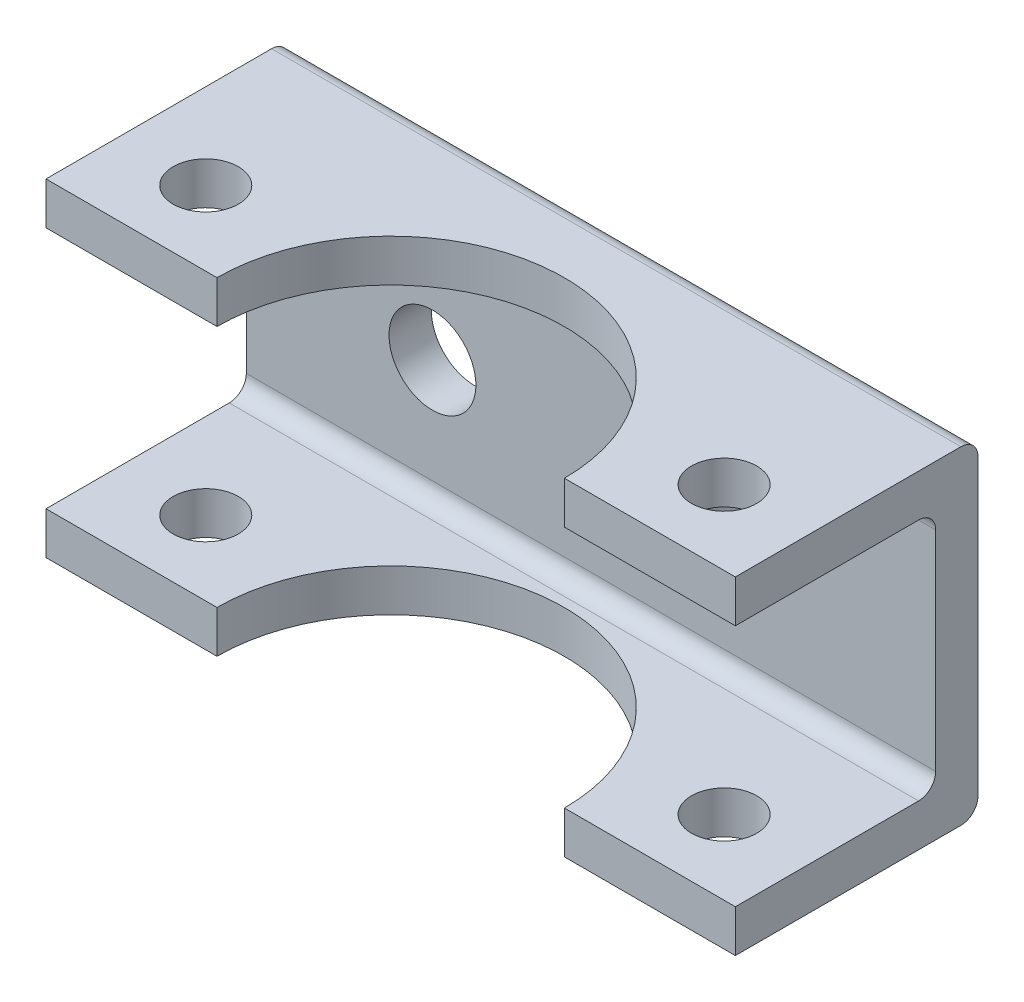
ISO-10303-21;
HEADER;
FILE_DESCRIPTION(('STEP AP214'),'2;1');
FILE_NAME('part.step','',(''),(''),'','','');
FILE_SCHEMA(('AUTOMOTIVE_DESIGN { 1 0 10303 214 1 1 1 1 }'));
ENDSEC;
DATA;
#1=APPLICATION_CONTEXT('core data for automotive mechanical design processes');
#2=APPLICATION_PROTOCOL_DEFINITION('international standard','automotive_design',2000,#1);
#3=PRODUCT_CONTEXT('',#1,'mechanical');
#4=PRODUCT('Part','Part','',(#3));
#5=PRODUCT_RELATED_PRODUCT_CATEGORY('part','',(#4));
#6=PRODUCT_DEFINITION_FORMATION('','',#4);
#7=PRODUCT_DEFINITION_CONTEXT('part definition',#1,'design');
#8=PRODUCT_DEFINITION('design','',#6,#7);
#9=PRODUCT_DEFINITION_SHAPE('','',#8);
#10=(LENGTH_UNIT() NAMED_UNIT(*) SI_UNIT(.MILLI.,.METRE.));
#11=(NAMED_UNIT(*) PLANE_ANGLE_UNIT() SI_UNIT($,.RADIAN.));
#12=(NAMED_UNIT(*) SI_UNIT($,.STERADIAN.) SOLID_ANGLE_UNIT());
#13=UNCERTAINTY_MEASURE_WITH_UNIT(LENGTH_MEASURE(1.E-05),#10,'distance_accuracy_value','');
#14=(GEOMETRIC_REPRESENTATION_CONTEXT(3) GLOBAL_UNCERTAINTY_ASSIGNED_CONTEXT((#13)) GLOBAL_UNIT_ASSIGNED_CONTEXT((#10,
#11,#12)) REPRESENTATION_CONTEXT('',''));
#15=CARTESIAN_POINT('',(0.,0.,0.));
#16=DIRECTION('',(0.,0.,1.));
#17=DIRECTION('',(1.,0.,0.));
#18=AXIS2_PLACEMENT_3D('',#15,#16,#17);
#19=CARTESIAN_POINT('',(0.,3.9,22.352));
#20=DIRECTION('',(0.,0.,-1.));
#21=DIRECTION('',(-1.,0.,0.));
#22=AXIS2_PLACEMENT_3D('',#19,#20,#21);
#23=PLANE('',#22);
#24=DIRECTION('',(1.,0.,0.));
#25=VECTOR('',#24,1.);
#26=CARTESIAN_POINT('',(0.,0.,22.352));
#27=LINE('',#26,#25);
#28=CARTESIAN_POINT('',(0.,0.,22.352));
#29=VERTEX_POINT('',#28);
#30=CARTESIAN_POINT('',(15.75,0.,22.352));
#31=VERTEX_POINT('',#30);
#32=EDGE_CURVE('E180',#29,#31,#27,.T.);
#33=ORIENTED_EDGE('',*,*,#32,.T.);
#34=DIRECTION('',(0.,1.,0.));
#35=VECTOR('',#34,1.);
#36=CARTESIAN_POINT('',(15.75,0.,22.352));
#37=LINE('',#36,#35);
#38=CARTESIAN_POINT('',(15.75,3.9,22.352));
#39=VERTEX_POINT('',#38);
#40=EDGE_CURVE('E160',#31,#39,#37,.T.);
#41=ORIENTED_EDGE('',*,*,#40,.T.);
#42=DIRECTION('',(1.,0.,0.));
#43=VECTOR('',#42,1.);
#44=CARTESIAN_POINT('',(0.,3.9,22.352));
#45=LINE('',#44,#43);
#46=CARTESIAN_POINT('',(0.,3.9,22.352));
#47=VERTEX_POINT('',#46);
#48=EDGE_CURVE('E338',#47,#39,#45,.T.);
#49=ORIENTED_EDGE('',*,*,#48,.F.);
#50=DIRECTION('',(0.,-1.,0.));
#51=VECTOR('',#50,1.);
#52=CARTESIAN_POINT('',(0.,3.9,22.352));
#53=LINE('',#52,#51);
#54=EDGE_CURVE('E188',#47,#29,#53,.T.);
#55=ORIENTED_EDGE('',*,*,#54,.T.);
#56=EDGE_LOOP('',(#33,#41,#49,#55));
#57=FACE_BOUND('',#56,.T.);
#58=ADVANCED_FACE('F45',(#57),#23,.F.);
#59=CARTESIAN_POINT('',(0.,30.21,22.352));
#60=DIRECTION('',(0.,0.,-1.));
#61=DIRECTION('',(-1.,0.,0.));
#62=AXIS2_PLACEMENT_3D('',#59,#60,#61);
#63=PLANE('',#62);
#64=DIRECTION('',(1.,0.,0.));
#65=VECTOR('',#64,1.);
#66=CARTESIAN_POINT('',(0.,26.31,22.352));
#67=LINE('',#66,#65);
#68=CARTESIAN_POINT('',(0.,26.31,22.352));
#69=VERTEX_POINT('',#68);
#70=CARTESIAN_POINT('',(15.75,26.31,22.352));
#71=VERTEX_POINT('',#70);
#72=EDGE_CURVE('E327',#69,#71,#67,.T.);
#73=ORIENTED_EDGE('',*,*,#72,.T.);
#74=CARTESIAN_POINT('',(15.75,30.21,22.352));
#75=VERTEX_POINT('',#74);
#76=EDGE_CURVE('E173',#71,#75,#37,.T.);
#77=ORIENTED_EDGE('',*,*,#76,.T.);
#78=DIRECTION('',(1.,0.,0.));
#79=VECTOR('',#78,1.);
#80=CARTESIAN_POINT('',(0.,30.21,22.352));
#81=LINE('',#80,#79);
#82=CARTESIAN_POINT('',(0.,30.21,22.352));
#83=VERTEX_POINT('',#82);
#84=EDGE_CURVE('E289',#83,#75,#81,.T.);
#85=ORIENTED_EDGE('',*,*,#84,.F.);
#86=DIRECTION('',(0.,-1.,0.));
#87=VECTOR('',#86,1.);
#88=CARTESIAN_POINT('',(0.,30.21,22.352));
#89=LINE('',#88,#87);
#90=EDGE_CURVE('E196',#83,#69,#89,.T.);
#91=ORIENTED_EDGE('',*,*,#90,.T.);
#92=EDGE_LOOP('',(#73,#77,#85,#91));
#93=FACE_BOUND('',#92,.T.);
#94=ADVANCED_FACE('F368',(#93),#63,.F.);
#95=CARTESIAN_POINT('',(0.,0.,3.9));
#96=DIRECTION('',(-1.,0.,0.));
#97=DIRECTION('',(0.,0.,1.));
#98=AXIS2_PLACEMENT_3D('',#95,#96,#97);
#99=PLANE('',#98);
#100=DIRECTION('',(0.,0.,1.));
#101=VECTOR('',#100,1.);
#102=CARTESIAN_POINT('',(0.,30.21,0.));
#103=LINE('',#102,#101);
#104=CARTESIAN_POINT('',(0.,30.21,1.5748));
#105=VERTEX_POINT('',#104);
#106=EDGE_CURVE('E297',#105,#83,#103,.T.);
#107=ORIENTED_EDGE('',*,*,#106,.F.);
#108=CARTESIAN_POINT('',(0.,28.6352,1.5748));
#109=DIRECTION('',(-1.,0.,0.));
#110=DIRECTION('',(0.,0.,1.));
#111=AXIS2_PLACEMENT_3D('',#108,#109,#110);
#112=CIRCLE('',#111,1.5748);
#113=CARTESIAN_POINT('',(0.,28.6352,0.));
#114=VERTEX_POINT('',#113);
#115=EDGE_CURVE('E261',#105,#114,#112,.T.);
#116=ORIENTED_EDGE('',*,*,#115,.T.);
#117=DIRECTION('',(0.,1.,0.));
#118=VECTOR('',#117,1.);
#119=CARTESIAN_POINT('',(0.,0.,0.));
#120=LINE('',#119,#118);
#121=CARTESIAN_POINT('',(0.,1.5748,0.));
#122=VERTEX_POINT('',#121);
#123=EDGE_CURVE('E207',#122,#114,#120,.T.);
#124=ORIENTED_EDGE('',*,*,#123,.F.);
#125=CARTESIAN_POINT('',(0.,1.5748,1.5748));
#126=DIRECTION('',(-1.,0.,0.));
#127=DIRECTION('',(0.,0.,1.));
#128=AXIS2_PLACEMENT_3D('',#125,#126,#127);
#129=CIRCLE('',#128,1.5748);
#130=CARTESIAN_POINT('',(0.,0.,1.5748));
#131=VERTEX_POINT('',#130);
#132=EDGE_CURVE('E258',#122,#131,#129,.T.);
#133=ORIENTED_EDGE('',*,*,#132,.T.);
#134=DIRECTION('',(0.,0.,-1.));
#135=VECTOR('',#134,1.);
#136=CARTESIAN_POINT('',(0.,0.,3.9));
#137=LINE('',#136,#135);
#138=EDGE_CURVE('E222',#29,#131,#137,.T.);
#139=ORIENTED_EDGE('',*,*,#138,.F.);
#140=ORIENTED_EDGE('',*,*,#54,.F.);
#141=DIRECTION('',(0.,0.,1.));
#142=VECTOR('',#141,1.);
#143=CARTESIAN_POINT('',(0.,3.9,0.));
#144=LINE('',#143,#142);
#145=CARTESIAN_POINT('',(0.,3.9,5.4748));
#146=VERTEX_POINT('',#145);
#147=EDGE_CURVE('E190',#146,#47,#144,.T.);
#148=ORIENTED_EDGE('',*,*,#147,.F.);
#149=CARTESIAN_POINT('',(0.,5.4748,5.4748));
#150=DIRECTION('',(-1.,0.,0.));
#151=DIRECTION('',(0.,0.,1.));
#152=AXIS2_PLACEMENT_3D('',#149,#150,#151);
#153=CIRCLE('',#152,1.5748);
#154=CARTESIAN_POINT('',(0.,5.4748,3.9));
#155=VERTEX_POINT('',#154);
#156=EDGE_CURVE('E238',#146,#155,#153,.F.);
#157=ORIENTED_EDGE('',*,*,#156,.T.);
#158=DIRECTION('',(0.,1.,0.));
#159=VECTOR('',#158,1.);
#160=CARTESIAN_POINT('',(0.,0.,3.9));
#161=LINE('',#160,#159);
#162=CARTESIAN_POINT('',(0.,24.7352,3.9));
#163=VERTEX_POINT('',#162);
#164=EDGE_CURVE('E208',#155,#163,#161,.T.);
#165=ORIENTED_EDGE('',*,*,#164,.T.);
#166=CARTESIAN_POINT('',(0.,24.7352,5.4748));
#167=DIRECTION('',(-1.,0.,0.));
#168=DIRECTION('',(0.,0.,1.));
#169=AXIS2_PLACEMENT_3D('',#166,#167,#168);
#170=CIRCLE('',#169,1.5748);
#171=CARTESIAN_POINT('',(0.,26.31,5.4748));
#172=VERTEX_POINT('',#171);
#173=EDGE_CURVE('E251',#163,#172,#170,.F.);
#174=ORIENTED_EDGE('',*,*,#173,.T.);
#175=DIRECTION('',(0.,0.,1.));
#176=VECTOR('',#175,1.);
#177=CARTESIAN_POINT('',(0.,26.31,0.));
#178=LINE('',#177,#176);
#179=EDGE_CURVE('E317',#172,#69,#178,.T.);
#180=ORIENTED_EDGE('',*,*,#179,.T.);
#181=ORIENTED_EDGE('',*,*,#90,.F.);
#182=EDGE_LOOP('',(#107,#116,#124,#133,#139,#140,#148,#157,#165,#174,#180,#181));
#183=FACE_BOUND('',#182,.T.);
#184=ADVANCED_FACE('F294',(#183),#99,.T.);
#185=CARTESIAN_POINT('',(0.,0.,3.9));
#186=DIRECTION('',(0.,1.,0.));
#187=DIRECTION('',(0.,0.,1.));
#188=AXIS2_PLACEMENT_3D('',#185,#186,#187);
#189=PLANE('',#188);
#190=CARTESIAN_POINT('',(7.875,0.,15.512));
#191=DIRECTION('',(0.,1.,0.));
#192=DIRECTION('',(0.,0.,1.));
#193=AXIS2_PLACEMENT_3D('',#190,#191,#192);
#194=CIRCLE('',#193,3.);
#195=CARTESIAN_POINT('',(7.875,0.,18.512));
#196=VERTEX_POINT('',#195);
#197=EDGE_CURVE('E410',#196,#196,#194,.T.);
#198=ORIENTED_EDGE('',*,*,#197,.T.);
#199=EDGE_LOOP('',(#198));
#200=FACE_BOUND('',#199,.T.);
#201=CARTESIAN_POINT('',(55.625,0.,15.512));
#202=DIRECTION('',(0.,1.,0.));
#203=DIRECTION('',(0.,0.,1.));
#204=AXIS2_PLACEMENT_3D('',#201,#202,#203);
#205=CIRCLE('',#204,3.);
#206=CARTESIAN_POINT('',(55.625,0.,18.512));
#207=VERTEX_POINT('',#206);
#208=EDGE_CURVE('E422',#207,#207,#205,.T.);
#209=ORIENTED_EDGE('',*,*,#208,.T.);
#210=EDGE_LOOP('',(#209));
#211=FACE_BOUND('',#210,.T.);
#212=ORIENTED_EDGE('',*,*,#138,.T.);
#213=DIRECTION('',(1.,0.,0.));
#214=VECTOR('',#213,1.);
#215=CARTESIAN_POINT('',(63.5,0.,1.5748));
#216=LINE('',#215,#214);
#217=CARTESIAN_POINT('',(63.5,0.,1.5748));
#218=VERTEX_POINT('',#217);
#219=EDGE_CURVE('E11',#131,#218,#216,.T.);
#220=ORIENTED_EDGE('',*,*,#219,.T.);
#221=DIRECTION('',(0.,0.,-1.));
#222=VECTOR('',#221,1.);
#223=CARTESIAN_POINT('',(63.5,0.,3.9));
#224=LINE('',#223,#222);
#225=CARTESIAN_POINT('',(63.5,0.,22.352));
#226=VERTEX_POINT('',#225);
#227=EDGE_CURVE('E217',#226,#218,#224,.T.);
#228=ORIENTED_EDGE('',*,*,#227,.F.);
#229=CARTESIAN_POINT('',(47.75,0.,22.352));
#230=VERTEX_POINT('',#229);
#231=EDGE_CURVE('E183',#230,#226,#27,.T.);
#232=ORIENTED_EDGE('',*,*,#231,.F.);
#233=CARTESIAN_POINT('',(31.75,0.,22.352));
#234=DIRECTION('',(0.,1.,0.));
#235=DIRECTION('',(0.,0.,1.));
#236=AXIS2_PLACEMENT_3D('',#233,#234,#235);
#237=CIRCLE('',#236,16.);
#238=EDGE_CURVE('E163',#230,#31,#237,.T.);
#239=ORIENTED_EDGE('',*,*,#238,.T.);
#240=ORIENTED_EDGE('',*,*,#32,.F.);
#241=EDGE_LOOP('',(#212,#220,#228,#232,#239,#240));
#242=FACE_BOUND('',#241,.T.);
#243=ADVANCED_FACE('F179',(#200,#211,#242),#189,.F.);
#244=CARTESIAN_POINT('',(63.5,0.,3.9));
#245=DIRECTION('',(-1.,0.,0.));
#246=DIRECTION('',(0.,0.,1.));
#247=AXIS2_PLACEMENT_3D('',#244,#245,#246);
#248=PLANE('',#247);
#249=DIRECTION('',(0.,1.,0.));
#250=VECTOR('',#249,1.);
#251=CARTESIAN_POINT('',(63.5,0.,0.));
#252=LINE('',#251,#250);
#253=CARTESIAN_POINT('',(63.5,1.5748,0.));
#254=VERTEX_POINT('',#253);
#255=CARTESIAN_POINT('',(63.5,28.6352,0.));
#256=VERTEX_POINT('',#255);
#257=EDGE_CURVE('E213',#254,#256,#252,.T.);
#258=ORIENTED_EDGE('',*,*,#257,.T.);
#259=CARTESIAN_POINT('',(63.5,28.6352,1.5748));
#260=DIRECTION('',(-1.,0.,0.));
#261=DIRECTION('',(0.,0.,1.));
#262=AXIS2_PLACEMENT_3D('',#259,#260,#261);
#263=CIRCLE('',#262,1.5748);
#264=CARTESIAN_POINT('',(63.5,30.21,1.5748));
#265=VERTEX_POINT('',#264);
#266=EDGE_CURVE('E54',#256,#265,#263,.F.);
#267=ORIENTED_EDGE('',*,*,#266,.T.);
#268=DIRECTION('',(0.,0.,-1.));
#269=VECTOR('',#268,1.);
#270=CARTESIAN_POINT('',(63.5,30.21,0.));
#271=LINE('',#270,#269);
#272=CARTESIAN_POINT('',(63.5,30.21,22.352));
#273=VERTEX_POINT('',#272);
#274=EDGE_CURVE('E277',#273,#265,#271,.T.);
#275=ORIENTED_EDGE('',*,*,#274,.F.);
#276=DIRECTION('',(0.,-1.,0.));
#277=VECTOR('',#276,1.);
#278=CARTESIAN_POINT('',(63.5,30.21,22.352));
#279=LINE('',#278,#277);
#280=CARTESIAN_POINT('',(63.5,26.31,22.352));
#281=VERTEX_POINT('',#280);
#282=EDGE_CURVE('E288',#273,#281,#279,.T.);
#283=ORIENTED_EDGE('',*,*,#282,.T.);
#284=DIRECTION('',(0.,0.,-1.));
#285=VECTOR('',#284,1.);
#286=CARTESIAN_POINT('',(63.5,26.31,0.));
#287=LINE('',#286,#285);
#288=CARTESIAN_POINT('',(63.5,26.31,5.4748));
#289=VERTEX_POINT('',#288);
#290=EDGE_CURVE('E320',#281,#289,#287,.T.);
#291=ORIENTED_EDGE('',*,*,#290,.T.);
#292=CARTESIAN_POINT('',(63.5,24.7352,5.4748));
#293=DIRECTION('',(-1.,0.,0.));
#294=DIRECTION('',(0.,0.,1.));
#295=AXIS2_PLACEMENT_3D('',#292,#293,#294);
#296=CIRCLE('',#295,1.5748);
#297=CARTESIAN_POINT('',(63.5,24.7352,3.9));
#298=VERTEX_POINT('',#297);
#299=EDGE_CURVE('E248',#289,#298,#296,.T.);
#300=ORIENTED_EDGE('',*,*,#299,.T.);
#301=DIRECTION('',(0.,1.,0.));
#302=VECTOR('',#301,1.);
#303=CARTESIAN_POINT('',(63.5,0.,3.9));
#304=LINE('',#303,#302);
#305=CARTESIAN_POINT('',(63.5,5.4748,3.9));
#306=VERTEX_POINT('',#305);
#307=EDGE_CURVE('E212',#306,#298,#304,.T.);
#308=ORIENTED_EDGE('',*,*,#307,.F.);
#309=CARTESIAN_POINT('',(63.5,5.4748,5.4748));
#310=DIRECTION('',(-1.,0.,0.));
#311=DIRECTION('',(0.,0.,1.));
#312=AXIS2_PLACEMENT_3D('',#309,#310,#311);
#313=CIRCLE('',#312,1.5748);
#314=CARTESIAN_POINT('',(63.5,3.9,5.4748));
#315=VERTEX_POINT('',#314);
#316=EDGE_CURVE('E235',#306,#315,#313,.T.);
#317=ORIENTED_EDGE('',*,*,#316,.T.);
#318=DIRECTION('',(0.,0.,-1.));
#319=VECTOR('',#318,1.);
#320=CARTESIAN_POINT('',(63.5,3.9,0.));
#321=LINE('',#320,#319);
#322=CARTESIAN_POINT('',(63.5,3.9,22.352));
#323=VERTEX_POINT('',#322);
#324=EDGE_CURVE('E199',#323,#315,#321,.T.);
#325=ORIENTED_EDGE('',*,*,#324,.F.);
#326=DIRECTION('',(0.,-1.,0.));
#327=VECTOR('',#326,1.);
#328=CARTESIAN_POINT('',(63.5,3.9,22.352));
#329=LINE('',#328,#327);
#330=EDGE_CURVE('E201',#323,#226,#329,.T.);
#331=ORIENTED_EDGE('',*,*,#330,.T.);
#332=ORIENTED_EDGE('',*,*,#227,.T.);
#333=CARTESIAN_POINT('',(63.5,1.5748,1.5748));
#334=DIRECTION('',(-1.,0.,0.));
#335=DIRECTION('',(0.,0.,1.));
#336=AXIS2_PLACEMENT_3D('',#333,#334,#335);
#337=CIRCLE('',#336,1.5748);
#338=EDGE_CURVE('E61',#218,#254,#337,.F.);
#339=ORIENTED_EDGE('',*,*,#338,.T.);
#340=EDGE_LOOP('',(#258,#267,#275,#283,#291,#300,#308,#317,#325,#331,#332,#339));
#341=FACE_BOUND('',#340,.T.);
#342=ADVANCED_FACE('F275',(#341),#248,.F.);
#343=CARTESIAN_POINT('',(0.,0.,3.9));
#344=DIRECTION('',(0.,0.,-1.));
#345=DIRECTION('',(-1.,0.,0.));
#346=AXIS2_PLACEMENT_3D('',#343,#344,#345);
#347=PLANE('',#346);
#348=CARTESIAN_POINT('',(46.355,15.105,3.9));
#349=DIRECTION('',(0.,0.,-1.));
#350=DIRECTION('',(-1.,0.,0.));
#351=AXIS2_PLACEMENT_3D('',#348,#349,#350);
#352=CIRCLE('',#351,4.);
#353=CARTESIAN_POINT('',(42.355,15.105,3.9));
#354=VERTEX_POINT('',#353);
#355=EDGE_CURVE('E371',#354,#354,#352,.T.);
#356=ORIENTED_EDGE('',*,*,#355,.T.);
#357=EDGE_LOOP('',(#356));
#358=FACE_BOUND('',#357,.T.);
#359=CARTESIAN_POINT('',(17.145,15.105,3.9));
#360=DIRECTION('',(0.,0.,-1.));
#361=DIRECTION('',(-1.,0.,0.));
#362=AXIS2_PLACEMENT_3D('',#359,#360,#361);
#363=CIRCLE('',#362,4.);
#364=CARTESIAN_POINT('',(13.145,15.105,3.9));
#365=VERTEX_POINT('',#364);
#366=EDGE_CURVE('E382',#365,#365,#363,.T.);
#367=ORIENTED_EDGE('',*,*,#366,.T.);
#368=EDGE_LOOP('',(#367));
#369=FACE_BOUND('',#368,.T.);
#370=ORIENTED_EDGE('',*,*,#307,.T.);
#371=DIRECTION('',(1.,0.,0.));
#372=VECTOR('',#371,1.);
#373=CARTESIAN_POINT('',(0.,24.7352,3.9));
#374=LINE('',#373,#372);
#375=EDGE_CURVE('E245',#298,#163,#374,.F.);
#376=ORIENTED_EDGE('',*,*,#375,.T.);
#377=ORIENTED_EDGE('',*,*,#164,.F.);
#378=DIRECTION('',(1.,0.,0.));
#379=VECTOR('',#378,1.);
#380=CARTESIAN_POINT('',(0.,5.4748,3.9));
#381=LINE('',#380,#379);
#382=EDGE_CURVE('E225',#155,#306,#381,.T.);
#383=ORIENTED_EDGE('',*,*,#382,.T.);
#384=EDGE_LOOP('',(#370,#376,#377,#383));
#385=FACE_BOUND('',#384,.T.);
#386=ADVANCED_FACE('F353',(#358,#369,#385),#347,.F.);
#387=CARTESIAN_POINT('',(0.,0.,0.));
#388=DIRECTION('',(0.,0.,-1.));
#389=DIRECTION('',(-1.,0.,0.));
#390=AXIS2_PLACEMENT_3D('',#387,#388,#389);
#391=PLANE('',#390);
#392=CARTESIAN_POINT('',(46.355,15.105,0.));
#393=DIRECTION('',(0.,0.,-1.));
#394=DIRECTION('',(-1.,0.,0.));
#395=AXIS2_PLACEMENT_3D('',#392,#393,#394);
#396=CIRCLE('',#395,4.);
#397=CARTESIAN_POINT('',(42.355,15.105,0.));
#398=VERTEX_POINT('',#397);
#399=EDGE_CURVE('E386',#398,#398,#396,.T.);
#400=ORIENTED_EDGE('',*,*,#399,.F.);
#401=EDGE_LOOP('',(#400));
#402=FACE_BOUND('',#401,.T.);
#403=CARTESIAN_POINT('',(17.145,15.105,0.));
#404=DIRECTION('',(0.,0.,-1.));
#405=DIRECTION('',(-1.,0.,0.));
#406=AXIS2_PLACEMENT_3D('',#403,#404,#405);
#407=CIRCLE('',#406,4.);
#408=CARTESIAN_POINT('',(13.145,15.105,0.));
#409=VERTEX_POINT('',#408);
#410=EDGE_CURVE('E390',#409,#409,#407,.T.);
#411=ORIENTED_EDGE('',*,*,#410,.F.);
#412=EDGE_LOOP('',(#411));
#413=FACE_BOUND('',#412,.T.);
#414=ORIENTED_EDGE('',*,*,#123,.T.);
#415=DIRECTION('',(-1.,0.,0.));
#416=VECTOR('',#415,1.);
#417=CARTESIAN_POINT('',(0.,28.6352,0.));
#418=LINE('',#417,#416);
#419=EDGE_CURVE('E68',#114,#256,#418,.F.);
#420=ORIENTED_EDGE('',*,*,#419,.T.);
#421=ORIENTED_EDGE('',*,*,#257,.F.);
#422=DIRECTION('',(1.,0.,0.));
#423=VECTOR('',#422,1.);
#424=CARTESIAN_POINT('',(0.,1.5748,0.));
#425=LINE('',#424,#423);
#426=EDGE_CURVE('E264',#254,#122,#425,.F.);
#427=ORIENTED_EDGE('',*,*,#426,.T.);
#428=EDGE_LOOP('',(#414,#420,#421,#427));
#429=FACE_BOUND('',#428,.T.);
#430=ADVANCED_FACE('F298',(#402,#413,#429),#391,.T.);
#431=CARTESIAN_POINT('',(0.,3.9,0.));
#432=DIRECTION('',(0.,1.,0.));
#433=DIRECTION('',(0.,0.,1.));
#434=AXIS2_PLACEMENT_3D('',#431,#432,#433);
#435=PLANE('',#434);
#436=CARTESIAN_POINT('',(7.875,3.9,15.512));
#437=DIRECTION('',(0.,1.,0.));
#438=DIRECTION('',(0.,0.,1.));
#439=AXIS2_PLACEMENT_3D('',#436,#437,#438);
#440=CIRCLE('',#439,3.);
#441=CARTESIAN_POINT('',(7.875,3.9,18.512));
#442=VERTEX_POINT('',#441);
#443=EDGE_CURVE('E394',#442,#442,#440,.T.);
#444=ORIENTED_EDGE('',*,*,#443,.F.);
#445=EDGE_LOOP('',(#444));
#446=FACE_BOUND('',#445,.T.);
#447=CARTESIAN_POINT('',(55.625,3.9,15.512));
#448=DIRECTION('',(0.,1.,0.));
#449=DIRECTION('',(0.,0.,1.));
#450=AXIS2_PLACEMENT_3D('',#447,#448,#449);
#451=CIRCLE('',#450,3.);
#452=CARTESIAN_POINT('',(55.625,3.9,18.512));
#453=VERTEX_POINT('',#452);
#454=EDGE_CURVE('E402',#453,#453,#451,.T.);
#455=ORIENTED_EDGE('',*,*,#454,.F.);
#456=EDGE_LOOP('',(#455));
#457=FACE_BOUND('',#456,.T.);
#458=CARTESIAN_POINT('',(31.75,3.9,22.352));
#459=DIRECTION('',(0.,1.,0.));
#460=DIRECTION('',(0.,0.,1.));
#461=AXIS2_PLACEMENT_3D('',#458,#459,#460);
#462=CIRCLE('',#461,16.);
#463=CARTESIAN_POINT('',(47.75,3.9,22.352));
#464=VERTEX_POINT('',#463);
#465=EDGE_CURVE('E166',#464,#39,#462,.T.);
#466=ORIENTED_EDGE('',*,*,#465,.F.);
#467=EDGE_CURVE('E194',#464,#323,#45,.T.);
#468=ORIENTED_EDGE('',*,*,#467,.T.);
#469=ORIENTED_EDGE('',*,*,#324,.T.);
#470=DIRECTION('',(1.,0.,0.));
#471=VECTOR('',#470,1.);
#472=CARTESIAN_POINT('',(0.,3.9,5.4748));
#473=LINE('',#472,#471);
#474=EDGE_CURVE('E232',#315,#146,#473,.F.);
#475=ORIENTED_EDGE('',*,*,#474,.T.);
#476=ORIENTED_EDGE('',*,*,#147,.T.);
#477=ORIENTED_EDGE('',*,*,#48,.T.);
#478=EDGE_LOOP('',(#466,#468,#469,#475,#476,#477));
#479=FACE_BOUND('',#478,.T.);
#480=ADVANCED_FACE('F343',(#446,#457,#479),#435,.T.);
#481=ORIENTED_EDGE('',*,*,#467,.F.);
#482=DIRECTION('',(0.,1.,0.));
#483=VECTOR('',#482,1.);
#484=CARTESIAN_POINT('',(47.75,0.,22.352));
#485=LINE('',#484,#483);
#486=EDGE_CURVE('E305',#230,#464,#485,.T.);
#487=ORIENTED_EDGE('',*,*,#486,.F.);
#488=ORIENTED_EDGE('',*,*,#231,.T.);
#489=ORIENTED_EDGE('',*,*,#330,.F.);
#490=EDGE_LOOP('',(#481,#487,#488,#489));
#491=FACE_BOUND('',#490,.T.);
#492=ADVANCED_FACE('F304',(#491),#23,.F.);
#493=CARTESIAN_POINT('',(0.,5.4748,5.4748));
#494=DIRECTION('',(1.,0.,0.));
#495=DIRECTION('',(0.,0.,-1.));
#496=AXIS2_PLACEMENT_3D('',#493,#494,#495);
#497=CYLINDRICAL_SURFACE('',#496,1.5748);
#498=ORIENTED_EDGE('',*,*,#156,.F.);
#499=ORIENTED_EDGE('',*,*,#474,.F.);
#500=ORIENTED_EDGE('',*,*,#316,.F.);
#501=ORIENTED_EDGE('',*,*,#382,.F.);
#502=EDGE_LOOP('',(#498,#499,#500,#501));
#503=FACE_BOUND('',#502,.T.);
#504=ADVANCED_FACE('F348',(#503),#497,.F.);
#505=CARTESIAN_POINT('',(0.,26.31,0.));
#506=DIRECTION('',(0.,1.,0.));
#507=DIRECTION('',(0.,0.,1.));
#508=AXIS2_PLACEMENT_3D('',#505,#506,#507);
#509=PLANE('',#508);
#510=CARTESIAN_POINT('',(7.875,26.31,15.512));
#511=DIRECTION('',(0.,1.,0.));
#512=DIRECTION('',(0.,0.,1.));
#513=AXIS2_PLACEMENT_3D('',#510,#511,#512);
#514=CIRCLE('',#513,3.);
#515=CARTESIAN_POINT('',(7.875,26.31,18.512));
#516=VERTEX_POINT('',#515);
#517=EDGE_CURVE('E398',#516,#516,#514,.T.);
#518=ORIENTED_EDGE('',*,*,#517,.T.);
#519=EDGE_LOOP('',(#518));
#520=FACE_BOUND('',#519,.T.);
#521=CARTESIAN_POINT('',(55.625,26.31,15.512));
#522=DIRECTION('',(0.,1.,0.));
#523=DIRECTION('',(0.,0.,1.));
#524=AXIS2_PLACEMENT_3D('',#521,#522,#523);
#525=CIRCLE('',#524,3.);
#526=CARTESIAN_POINT('',(55.625,26.31,18.512));
#527=VERTEX_POINT('',#526);
#528=EDGE_CURVE('E406',#527,#527,#525,.T.);
#529=ORIENTED_EDGE('',*,*,#528,.T.);
#530=EDGE_LOOP('',(#529));
#531=FACE_BOUND('',#530,.T.);
#532=CARTESIAN_POINT('',(47.75,26.31,22.352));
#533=VERTEX_POINT('',#532);
#534=EDGE_CURVE('E326',#533,#281,#67,.T.);
#535=ORIENTED_EDGE('',*,*,#534,.F.);
#536=CARTESIAN_POINT('',(31.75,26.31,22.352));
#537=DIRECTION('',(0.,1.,0.));
#538=DIRECTION('',(0.,0.,1.));
#539=AXIS2_PLACEMENT_3D('',#536,#537,#538);
#540=CIRCLE('',#539,16.);
#541=EDGE_CURVE('E307',#533,#71,#540,.T.);
#542=ORIENTED_EDGE('',*,*,#541,.T.);
#543=ORIENTED_EDGE('',*,*,#72,.F.);
#544=ORIENTED_EDGE('',*,*,#179,.F.);
#545=DIRECTION('',(1.,0.,0.));
#546=VECTOR('',#545,1.);
#547=CARTESIAN_POINT('',(63.5,26.31,5.4748));
#548=LINE('',#547,#546);
#549=EDGE_CURVE('E241',#172,#289,#548,.T.);
#550=ORIENTED_EDGE('',*,*,#549,.T.);
#551=ORIENTED_EDGE('',*,*,#290,.F.);
#552=EDGE_LOOP('',(#535,#542,#543,#544,#550,#551));
#553=FACE_BOUND('',#552,.T.);
#554=ADVANCED_FACE('F363',(#520,#531,#553),#509,.F.);
#555=CARTESIAN_POINT('',(47.75,30.21,22.352));
#556=VERTEX_POINT('',#555);
#557=EDGE_CURVE('E285',#556,#273,#81,.T.);
#558=ORIENTED_EDGE('',*,*,#557,.F.);
#559=EDGE_CURVE('E172',#533,#556,#485,.T.);
#560=ORIENTED_EDGE('',*,*,#559,.F.);
#561=ORIENTED_EDGE('',*,*,#534,.T.);
#562=ORIENTED_EDGE('',*,*,#282,.F.);
#563=EDGE_LOOP('',(#558,#560,#561,#562));
#564=FACE_BOUND('',#563,.T.);
#565=ADVANCED_FACE('F374',(#564),#63,.F.);
#566=CARTESIAN_POINT('',(0.,30.21,0.));
#567=DIRECTION('',(0.,1.,0.));
#568=DIRECTION('',(0.,0.,1.));
#569=AXIS2_PLACEMENT_3D('',#566,#567,#568);
#570=PLANE('',#569);
#571=CARTESIAN_POINT('',(7.875,30.21,15.512));
#572=DIRECTION('',(0.,1.,0.));
#573=DIRECTION('',(0.,0.,1.));
#574=AXIS2_PLACEMENT_3D('',#571,#572,#573);
#575=CIRCLE('',#574,3.);
#576=CARTESIAN_POINT('',(7.875,30.21,18.512));
#577=VERTEX_POINT('',#576);
#578=EDGE_CURVE('E414',#577,#577,#575,.T.);
#579=ORIENTED_EDGE('',*,*,#578,.F.);
#580=EDGE_LOOP('',(#579));
#581=FACE_BOUND('',#580,.T.);
#582=CARTESIAN_POINT('',(55.625,30.21,15.512));
#583=DIRECTION('',(0.,1.,0.));
#584=DIRECTION('',(0.,0.,1.));
#585=AXIS2_PLACEMENT_3D('',#582,#583,#584);
#586=CIRCLE('',#585,3.);
#587=CARTESIAN_POINT('',(55.625,30.21,18.512));
#588=VERTEX_POINT('',#587);
#589=EDGE_CURVE('E418',#588,#588,#586,.T.);
#590=ORIENTED_EDGE('',*,*,#589,.F.);
#591=EDGE_LOOP('',(#590));
#592=FACE_BOUND('',#591,.T.);
#593=ORIENTED_EDGE('',*,*,#274,.T.);
#594=DIRECTION('',(-1.,0.,0.));
#595=VECTOR('',#594,1.);
#596=CARTESIAN_POINT('',(0.,30.21,1.5748));
#597=LINE('',#596,#595);
#598=EDGE_CURVE('E254',#265,#105,#597,.T.);
#599=ORIENTED_EDGE('',*,*,#598,.T.);
#600=ORIENTED_EDGE('',*,*,#106,.T.);
#601=ORIENTED_EDGE('',*,*,#84,.T.);
#602=CARTESIAN_POINT('',(31.75,30.21,22.352));
#603=DIRECTION('',(0.,1.,0.));
#604=DIRECTION('',(0.,0.,1.));
#605=AXIS2_PLACEMENT_3D('',#602,#603,#604);
#606=CIRCLE('',#605,16.);
#607=EDGE_CURVE('E185',#556,#75,#606,.T.);
#608=ORIENTED_EDGE('',*,*,#607,.F.);
#609=ORIENTED_EDGE('',*,*,#557,.T.);
#610=EDGE_LOOP('',(#593,#599,#600,#601,#608,#609));
#611=FACE_BOUND('',#610,.T.);
#612=ADVANCED_FACE('F281',(#581,#592,#611),#570,.T.);
#613=CARTESIAN_POINT('',(0.,24.7352,5.4748));
#614=DIRECTION('',(-1.,0.,0.));
#615=DIRECTION('',(0.,0.,1.));
#616=AXIS2_PLACEMENT_3D('',#613,#614,#615);
#617=CYLINDRICAL_SURFACE('',#616,1.5748);
#618=ORIENTED_EDGE('',*,*,#173,.F.);
#619=ORIENTED_EDGE('',*,*,#375,.F.);
#620=ORIENTED_EDGE('',*,*,#299,.F.);
#621=ORIENTED_EDGE('',*,*,#549,.F.);
#622=EDGE_LOOP('',(#618,#619,#620,#621));
#623=FACE_BOUND('',#622,.T.);
#624=ADVANCED_FACE('F357',(#623),#617,.F.);
#625=CARTESIAN_POINT('',(31.75,0.,22.352));
#626=DIRECTION('',(0.,1.,0.));
#627=DIRECTION('',(0.,0.,1.));
#628=AXIS2_PLACEMENT_3D('',#625,#626,#627);
#629=CYLINDRICAL_SURFACE('',#628,16.);
#630=ORIENTED_EDGE('',*,*,#559,.T.);
#631=ORIENTED_EDGE('',*,*,#607,.T.);
#632=ORIENTED_EDGE('',*,*,#76,.F.);
#633=ORIENTED_EDGE('',*,*,#541,.F.);
#634=EDGE_LOOP('',(#630,#631,#632,#633));
#635=FACE_BOUND('',#634,.T.);
#636=ADVANCED_FACE('F377',(#635),#629,.F.);
#637=ORIENTED_EDGE('',*,*,#465,.T.);
#638=ORIENTED_EDGE('',*,*,#40,.F.);
#639=ORIENTED_EDGE('',*,*,#238,.F.);
#640=ORIENTED_EDGE('',*,*,#486,.T.);
#641=EDGE_LOOP('',(#637,#638,#639,#640));
#642=FACE_BOUND('',#641,.T.);
#643=ADVANCED_FACE('F162',(#642),#629,.F.);
#644=CARTESIAN_POINT('',(17.145,15.105,10.));
#645=DIRECTION('',(0.,0.,-1.));
#646=DIRECTION('',(-1.,0.,0.));
#647=AXIS2_PLACEMENT_3D('',#644,#645,#646);
#648=CYLINDRICAL_SURFACE('',#647,4.);
#649=ORIENTED_EDGE('',*,*,#410,.T.);
#650=EDGE_LOOP('',(#649));
#651=FACE_BOUND('',#650,.T.);
#652=ORIENTED_EDGE('',*,*,#366,.F.);
#653=EDGE_LOOP('',(#652));
#654=FACE_BOUND('',#653,.T.);
#655=ADVANCED_FACE('F481',(#651,#654),#648,.F.);
#656=CARTESIAN_POINT('',(46.355,15.105,10.));
#657=DIRECTION('',(0.,0.,-1.));
#658=DIRECTION('',(-1.,0.,0.));
#659=AXIS2_PLACEMENT_3D('',#656,#657,#658);
#660=CYLINDRICAL_SURFACE('',#659,4.);
#661=ORIENTED_EDGE('',*,*,#399,.T.);
#662=EDGE_LOOP('',(#661));
#663=FACE_BOUND('',#662,.T.);
#664=ORIENTED_EDGE('',*,*,#355,.F.);
#665=EDGE_LOOP('',(#664));
#666=FACE_BOUND('',#665,.T.);
#667=ADVANCED_FACE('F445',(#663,#666),#660,.F.);
#668=CARTESIAN_POINT('',(55.625,0.,15.512));
#669=DIRECTION('',(0.,1.,0.));
#670=DIRECTION('',(0.,0.,1.));
#671=AXIS2_PLACEMENT_3D('',#668,#669,#670);
#672=CYLINDRICAL_SURFACE('',#671,3.);
#673=ORIENTED_EDGE('',*,*,#589,.T.);
#674=EDGE_LOOP('',(#673));
#675=FACE_BOUND('',#674,.T.);
#676=ORIENTED_EDGE('',*,*,#528,.F.);
#677=EDGE_LOOP('',(#676));
#678=FACE_BOUND('',#677,.T.);
#679=ADVANCED_FACE('F435',(#675,#678),#672,.F.);
#680=CARTESIAN_POINT('',(7.875,0.,15.512));
#681=DIRECTION('',(0.,1.,0.));
#682=DIRECTION('',(0.,0.,1.));
#683=AXIS2_PLACEMENT_3D('',#680,#681,#682);
#684=CYLINDRICAL_SURFACE('',#683,3.);
#685=ORIENTED_EDGE('',*,*,#578,.T.);
#686=EDGE_LOOP('',(#685));
#687=FACE_BOUND('',#686,.T.);
#688=ORIENTED_EDGE('',*,*,#517,.F.);
#689=EDGE_LOOP('',(#688));
#690=FACE_BOUND('',#689,.T.);
#691=ADVANCED_FACE('F432',(#687,#690),#684,.F.);
#692=ORIENTED_EDGE('',*,*,#454,.T.);
#693=EDGE_LOOP('',(#692));
#694=FACE_BOUND('',#693,.T.);
#695=ORIENTED_EDGE('',*,*,#208,.F.);
#696=EDGE_LOOP('',(#695));
#697=FACE_BOUND('',#696,.T.);
#698=ADVANCED_FACE('F429',(#694,#697),#672,.F.);
#699=ORIENTED_EDGE('',*,*,#443,.T.);
#700=EDGE_LOOP('',(#699));
#701=FACE_BOUND('',#700,.T.);
#702=ORIENTED_EDGE('',*,*,#197,.F.);
#703=EDGE_LOOP('',(#702));
#704=FACE_BOUND('',#703,.T.);
#705=ADVANCED_FACE('F431',(#701,#704),#684,.F.);
#706=CARTESIAN_POINT('',(0.,28.6352,1.5748));
#707=DIRECTION('',(-1.,0.,0.));
#708=DIRECTION('',(0.,0.,1.));
#709=AXIS2_PLACEMENT_3D('',#706,#707,#708);
#710=CYLINDRICAL_SURFACE('',#709,1.5748);
#711=ORIENTED_EDGE('',*,*,#266,.F.);
#712=ORIENTED_EDGE('',*,*,#419,.F.);
#713=ORIENTED_EDGE('',*,*,#115,.F.);
#714=ORIENTED_EDGE('',*,*,#598,.F.);
#715=EDGE_LOOP('',(#711,#712,#713,#714));
#716=FACE_BOUND('',#715,.T.);
#717=ADVANCED_FACE('F291',(#716),#710,.T.);
#718=CARTESIAN_POINT('',(0.,1.5748,1.5748));
#719=DIRECTION('',(-1.,0.,0.));
#720=DIRECTION('',(0.,0.,1.));
#721=AXIS2_PLACEMENT_3D('',#718,#719,#720);
#722=CYLINDRICAL_SURFACE('',#721,1.5748);
#723=ORIENTED_EDGE('',*,*,#132,.F.);
#724=ORIENTED_EDGE('',*,*,#426,.F.);
#725=ORIENTED_EDGE('',*,*,#338,.F.);
#726=ORIENTED_EDGE('',*,*,#219,.F.);
#727=EDGE_LOOP('',(#723,#724,#725,#726));
#728=FACE_BOUND('',#727,.T.);
#729=ADVANCED_FACE('F47',(#728),#722,.T.);
#730=CLOSED_SHELL('',(#58,#94,#184,#243,#342,#386,#430,#480,#492,#504,#554,#565,#612,#624,#636,
#643,#655,#667,#679,#691,#698,#705,#717,#729));
#731=MANIFOLD_SOLID_BREP('B2',#730);
#732=ADVANCED_BREP_SHAPE_REPRESENTATION('',(#18,#731),#14);
#733=SHAPE_DEFINITION_REPRESENTATION(#9,#732);
ENDSEC;
END-ISO-10303-21;
